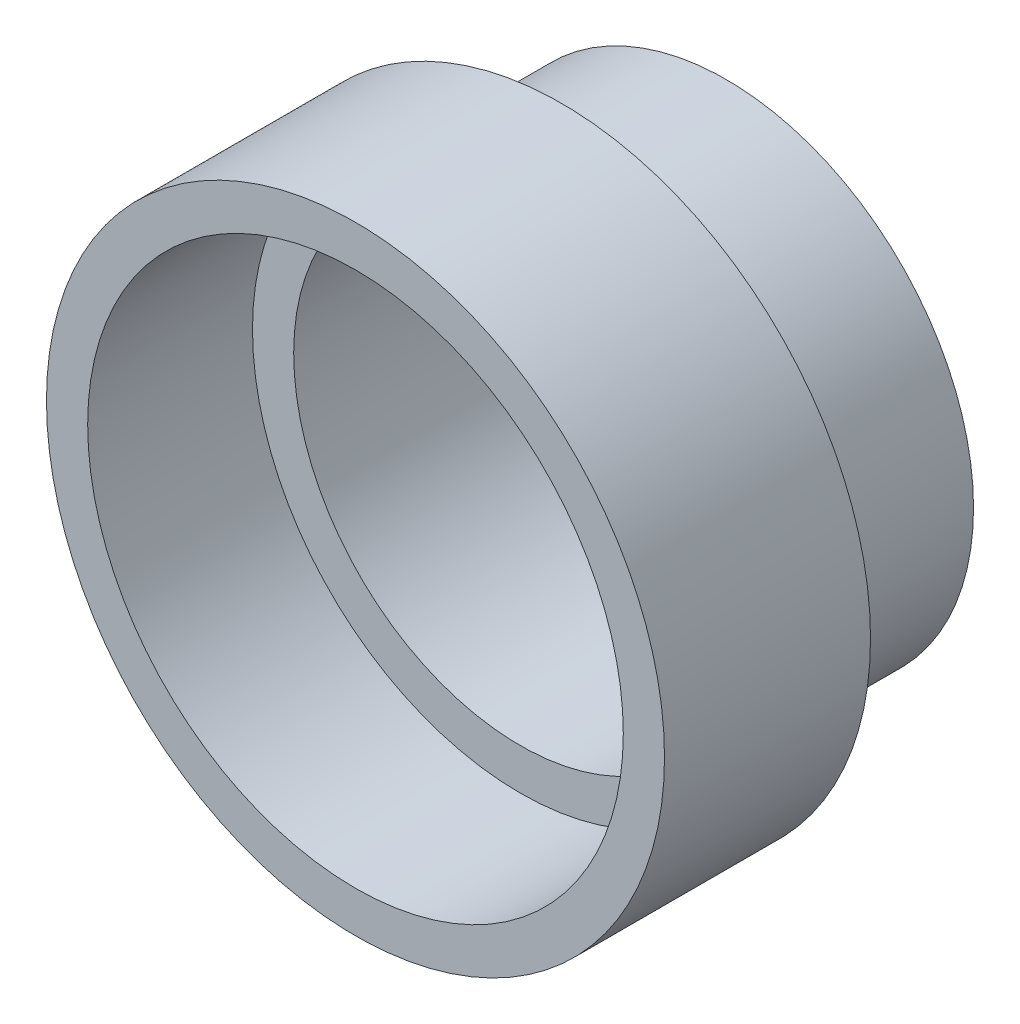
ISO-10303-21;
HEADER;
FILE_DESCRIPTION(('STEP AP214'),'2;1');
FILE_NAME('part.step','',(''),(''),'','','');
FILE_SCHEMA(('AUTOMOTIVE_DESIGN { 1 0 10303 214 1 1 1 1 }'));
ENDSEC;
DATA;
#1=APPLICATION_CONTEXT('core data for automotive mechanical design processes');
#2=APPLICATION_PROTOCOL_DEFINITION('international standard','automotive_design',2000,#1);
#3=PRODUCT_CONTEXT('',#1,'mechanical');
#4=PRODUCT('Part','Part','',(#3));
#5=PRODUCT_RELATED_PRODUCT_CATEGORY('part','',(#4));
#6=PRODUCT_DEFINITION_FORMATION('','',#4);
#7=PRODUCT_DEFINITION_CONTEXT('part definition',#1,'design');
#8=PRODUCT_DEFINITION('design','',#6,#7);
#9=PRODUCT_DEFINITION_SHAPE('','',#8);
#10=(LENGTH_UNIT() NAMED_UNIT(*) SI_UNIT(.MILLI.,.METRE.));
#11=(NAMED_UNIT(*) PLANE_ANGLE_UNIT() SI_UNIT($,.RADIAN.));
#12=(NAMED_UNIT(*) SI_UNIT($,.STERADIAN.) SOLID_ANGLE_UNIT());
#13=UNCERTAINTY_MEASURE_WITH_UNIT(LENGTH_MEASURE(1.E-05),#10,'distance_accuracy_value','');
#14=(GEOMETRIC_REPRESENTATION_CONTEXT(3) GLOBAL_UNCERTAINTY_ASSIGNED_CONTEXT((#13)) GLOBAL_UNIT_ASSIGNED_CONTEXT((#10,
#11,#12)) REPRESENTATION_CONTEXT('',''));
#15=CARTESIAN_POINT('',(0.,0.,0.));
#16=DIRECTION('',(0.,0.,1.));
#17=DIRECTION('',(1.,0.,0.));
#18=AXIS2_PLACEMENT_3D('',#15,#16,#17);
#19=CARTESIAN_POINT('',(0.,0.,10.));
#20=DIRECTION('',(0.,0.,-1.));
#21=DIRECTION('',(-1.,0.,0.));
#22=AXIS2_PLACEMENT_3D('',#19,#20,#21);
#23=CYLINDRICAL_SURFACE('',#22,15.);
#24=CARTESIAN_POINT('',(0.,0.,10.));
#25=DIRECTION('',(0.,0.,1.));
#26=DIRECTION('',(1.,0.,0.));
#27=AXIS2_PLACEMENT_3D('',#24,#25,#26);
#28=CIRCLE('',#27,15.);
#29=CARTESIAN_POINT('',(15.,0.,10.));
#30=VERTEX_POINT('',#29);
#31=EDGE_CURVE('E39',#30,#30,#28,.T.);
#32=ORIENTED_EDGE('',*,*,#31,.F.);
#33=EDGE_LOOP('',(#32));
#34=FACE_BOUND('',#33,.T.);
#35=CARTESIAN_POINT('',(0.,0.,0.));
#36=DIRECTION('',(0.,0.,1.));
#37=DIRECTION('',(1.,0.,0.));
#38=AXIS2_PLACEMENT_3D('',#35,#36,#37);
#39=CIRCLE('',#38,15.);
#40=CARTESIAN_POINT('',(15.,0.,0.));
#41=VERTEX_POINT('',#40);
#42=EDGE_CURVE('E43',#41,#41,#39,.T.);
#43=ORIENTED_EDGE('',*,*,#42,.T.);
#44=EDGE_LOOP('',(#43));
#45=FACE_BOUND('',#44,.T.);
#46=ADVANCED_FACE('F33',(#34,#45),#23,.T.);
#47=CARTESIAN_POINT('',(0.,0.,10.));
#48=DIRECTION('',(0.,0.,1.));
#49=DIRECTION('',(1.,0.,0.));
#50=AXIS2_PLACEMENT_3D('',#47,#48,#49);
#51=PLANE('',#50);
#52=CARTESIAN_POINT('',(0.,0.,10.));
#53=DIRECTION('',(0.,0.,1.));
#54=DIRECTION('',(1.,0.,0.));
#55=AXIS2_PLACEMENT_3D('',#52,#53,#54);
#56=CIRCLE('',#55,13.);
#57=CARTESIAN_POINT('',(13.,0.,10.));
#58=VERTEX_POINT('',#57);
#59=EDGE_CURVE('E50',#58,#58,#56,.T.);
#60=ORIENTED_EDGE('',*,*,#59,.F.);
#61=EDGE_LOOP('',(#60));
#62=FACE_BOUND('',#61,.T.);
#63=ORIENTED_EDGE('',*,*,#31,.T.);
#64=EDGE_LOOP('',(#63));
#65=FACE_BOUND('',#64,.T.);
#66=ADVANCED_FACE('F84',(#62,#65),#51,.T.);
#67=CARTESIAN_POINT('',(0.,0.,0.));
#68=DIRECTION('',(0.,0.,1.));
#69=DIRECTION('',(1.,0.,0.));
#70=AXIS2_PLACEMENT_3D('',#67,#68,#69);
#71=PLANE('',#70);
#72=CARTESIAN_POINT('',(0.,0.,0.));
#73=DIRECTION('',(0.,0.,1.));
#74=DIRECTION('',(1.,0.,0.));
#75=AXIS2_PLACEMENT_3D('',#72,#73,#74);
#76=CIRCLE('',#75,12.);
#77=CARTESIAN_POINT('',(12.,0.,0.));
#78=VERTEX_POINT('',#77);
#79=EDGE_CURVE('E10',#78,#78,#76,.F.);
#80=ORIENTED_EDGE('',*,*,#79,.F.);
#81=EDGE_LOOP('',(#80));
#82=FACE_BOUND('',#81,.T.);
#83=ORIENTED_EDGE('',*,*,#42,.F.);
#84=EDGE_LOOP('',(#83));
#85=FACE_BOUND('',#84,.T.);
#86=ADVANCED_FACE('F89',(#82,#85),#71,.F.);
#87=CARTESIAN_POINT('',(0.,0.,2.));
#88=DIRECTION('',(0.,0.,1.));
#89=DIRECTION('',(1.,0.,0.));
#90=AXIS2_PLACEMENT_3D('',#87,#88,#89);
#91=CYLINDRICAL_SURFACE('',#90,13.);
#92=CARTESIAN_POINT('',(0.,0.,2.));
#93=DIRECTION('',(0.,0.,1.));
#94=DIRECTION('',(1.,0.,0.));
#95=AXIS2_PLACEMENT_3D('',#92,#93,#94);
#96=CIRCLE('',#95,13.);
#97=CARTESIAN_POINT('',(13.,0.,2.));
#98=VERTEX_POINT('',#97);
#99=EDGE_CURVE('E48',#98,#98,#96,.T.);
#100=ORIENTED_EDGE('',*,*,#99,.F.);
#101=EDGE_LOOP('',(#100));
#102=FACE_BOUND('',#101,.T.);
#103=ORIENTED_EDGE('',*,*,#59,.T.);
#104=EDGE_LOOP('',(#103));
#105=FACE_BOUND('',#104,.T.);
#106=ADVANCED_FACE('F80',(#102,#105),#91,.F.);
#107=CARTESIAN_POINT('',(0.,0.,2.));
#108=DIRECTION('',(0.,0.,1.));
#109=DIRECTION('',(1.,0.,0.));
#110=AXIS2_PLACEMENT_3D('',#107,#108,#109);
#111=PLANE('',#110);
#112=CARTESIAN_POINT('',(0.,0.,2.));
#113=DIRECTION('',(0.,0.,1.));
#114=DIRECTION('',(1.,0.,0.));
#115=AXIS2_PLACEMENT_3D('',#112,#113,#114);
#116=CIRCLE('',#115,11.);
#117=CARTESIAN_POINT('',(11.,0.,2.));
#118=VERTEX_POINT('',#117);
#119=EDGE_CURVE('E58',#118,#118,#116,.T.);
#120=ORIENTED_EDGE('',*,*,#119,.F.);
#121=EDGE_LOOP('',(#120));
#122=FACE_BOUND('',#121,.T.);
#123=ORIENTED_EDGE('',*,*,#99,.T.);
#124=EDGE_LOOP('',(#123));
#125=FACE_BOUND('',#124,.T.);
#126=ADVANCED_FACE('F75',(#122,#125),#111,.T.);
#127=CARTESIAN_POINT('',(0.,0.,-8.));
#128=DIRECTION('',(0.,0.,1.));
#129=DIRECTION('',(1.,0.,0.));
#130=AXIS2_PLACEMENT_3D('',#127,#128,#129);
#131=CYLINDRICAL_SURFACE('',#130,12.);
#132=CARTESIAN_POINT('',(0.,0.,-8.));
#133=DIRECTION('',(0.,0.,-1.));
#134=DIRECTION('',(-1.,0.,0.));
#135=AXIS2_PLACEMENT_3D('',#132,#133,#134);
#136=CIRCLE('',#135,12.);
#137=CARTESIAN_POINT('',(-12.,0.,-8.));
#138=VERTEX_POINT('',#137);
#139=EDGE_CURVE('E53',#138,#138,#136,.T.);
#140=ORIENTED_EDGE('',*,*,#139,.F.);
#141=EDGE_LOOP('',(#140));
#142=FACE_BOUND('',#141,.T.);
#143=ORIENTED_EDGE('',*,*,#79,.T.);
#144=EDGE_LOOP('',(#143));
#145=FACE_BOUND('',#144,.T.);
#146=ADVANCED_FACE('F70',(#142,#145),#131,.T.);
#147=CARTESIAN_POINT('',(0.,0.,-8.));
#148=DIRECTION('',(0.,0.,-1.));
#149=DIRECTION('',(-1.,0.,0.));
#150=AXIS2_PLACEMENT_3D('',#147,#148,#149);
#151=PLANE('',#150);
#152=CARTESIAN_POINT('',(0.,0.,-8.));
#153=DIRECTION('',(0.,0.,-1.));
#154=DIRECTION('',(-1.,0.,0.));
#155=AXIS2_PLACEMENT_3D('',#152,#153,#154);
#156=CIRCLE('',#155,11.);
#157=CARTESIAN_POINT('',(-11.,0.,-8.));
#158=VERTEX_POINT('',#157);
#159=EDGE_CURVE('E61',#158,#158,#156,.T.);
#160=ORIENTED_EDGE('',*,*,#159,.F.);
#161=EDGE_LOOP('',(#160));
#162=FACE_BOUND('',#161,.T.);
#163=ORIENTED_EDGE('',*,*,#139,.T.);
#164=EDGE_LOOP('',(#163));
#165=FACE_BOUND('',#164,.T.);
#166=ADVANCED_FACE('F67',(#162,#165),#151,.T.);
#167=CARTESIAN_POINT('',(0.,0.,22.));
#168=DIRECTION('',(0.,0.,-1.));
#169=DIRECTION('',(-1.,0.,0.));
#170=AXIS2_PLACEMENT_3D('',#167,#168,#169);
#171=CYLINDRICAL_SURFACE('',#170,11.);
#172=ORIENTED_EDGE('',*,*,#119,.T.);
#173=EDGE_LOOP('',(#172));
#174=FACE_BOUND('',#173,.T.);
#175=ORIENTED_EDGE('',*,*,#159,.T.);
#176=EDGE_LOOP('',(#175));
#177=FACE_BOUND('',#176,.T.);
#178=ADVANCED_FACE('F65',(#174,#177),#171,.F.);
#179=CLOSED_SHELL('',(#46,#66,#86,#106,#126,#146,#166,#178));
#180=MANIFOLD_SOLID_BREP('B2',#179);
#181=ADVANCED_BREP_SHAPE_REPRESENTATION('',(#18,#180),#14);
#182=SHAPE_DEFINITION_REPRESENTATION(#9,#181);
ENDSEC;
END-ISO-10303-21;
